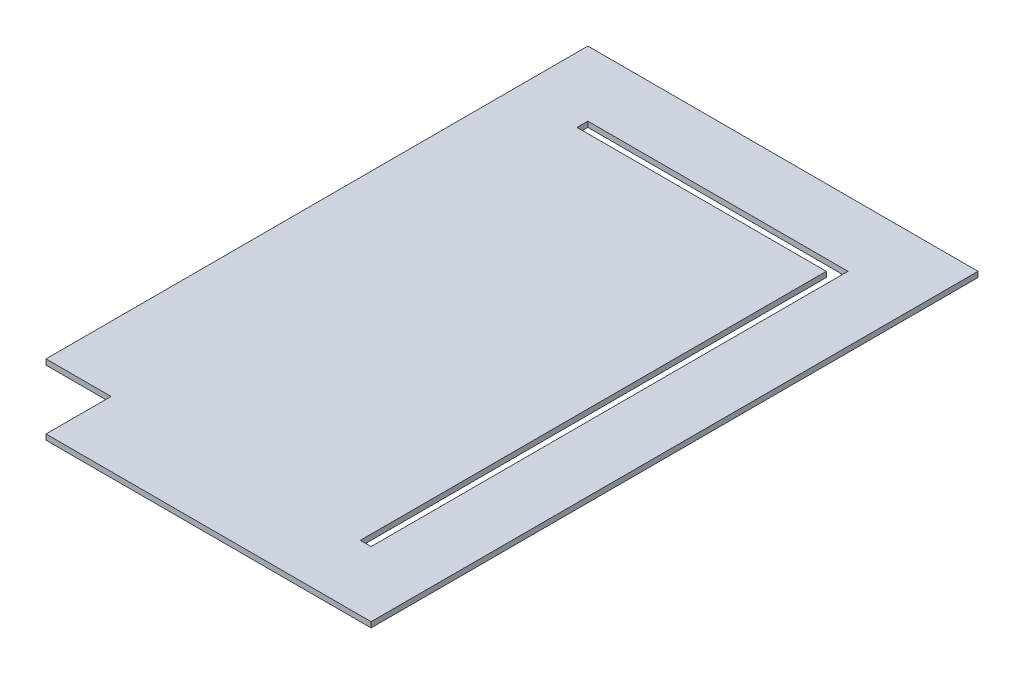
from build123d import *

# Parameters (mm, degrees)
SKETCH2_W           = 228.6
SKETCH2_H           = 355.6
BOSS_EXTRUDE1_DEPTH = 3.175
SKETCH3_W           = 6.35
SKETCH3_H           = 273.05
CUT_EXTRUDE1_DEPTH  = 212.393970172
SKETCH4_W           = 38.1
SKETCH4_H           = 38.1
CUT_EXTRUDE2_DEPTH  = 212.393970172


with BuildPart() as part:
    # Sketch2 → Boss-Extrude1 (new body)
    with BuildSketch(Plane(origin=(0, 0, 0), x_dir=(1, 0, 0), z_dir=(0, 1, 0))):
        Rectangle(SKETCH2_W, SKETCH2_H)
    extrude(amount=BOSS_EXTRUDE1_DEPTH)

    # Sketch3 → Cut-Extrude1 (cut, through all)
    with BuildSketch(Plane(origin=(0, 3.175, 0), x_dir=(1, 0, 0), z_dir=(0, 1, 0))):
        Polygon((76.2, 139.7), (-76.2, 139.7), (-76.2, 133.35), (69.85, 133.35), (76.2, 133.35), align=None)
        with Locations((73.025, -3.175)):
            Rectangle(SKETCH3_W, SKETCH3_H)
    extrude(amount=-CUT_EXTRUDE1_DEPTH, mode=Mode.SUBTRACT)

    # Sketch4 → Cut-Extrude2 (cut, through all)
    with BuildSketch(Plane(origin=(0, 3.175, 0), x_dir=(1, 0, 0), z_dir=(0, 1, 0))):
        with Locations((-95.25, -158.75)):
            Rectangle(SKETCH4_W, SKETCH4_H)
    extrude(amount=-CUT_EXTRUDE2_DEPTH, mode=Mode.SUBTRACT)


solid = part.part
